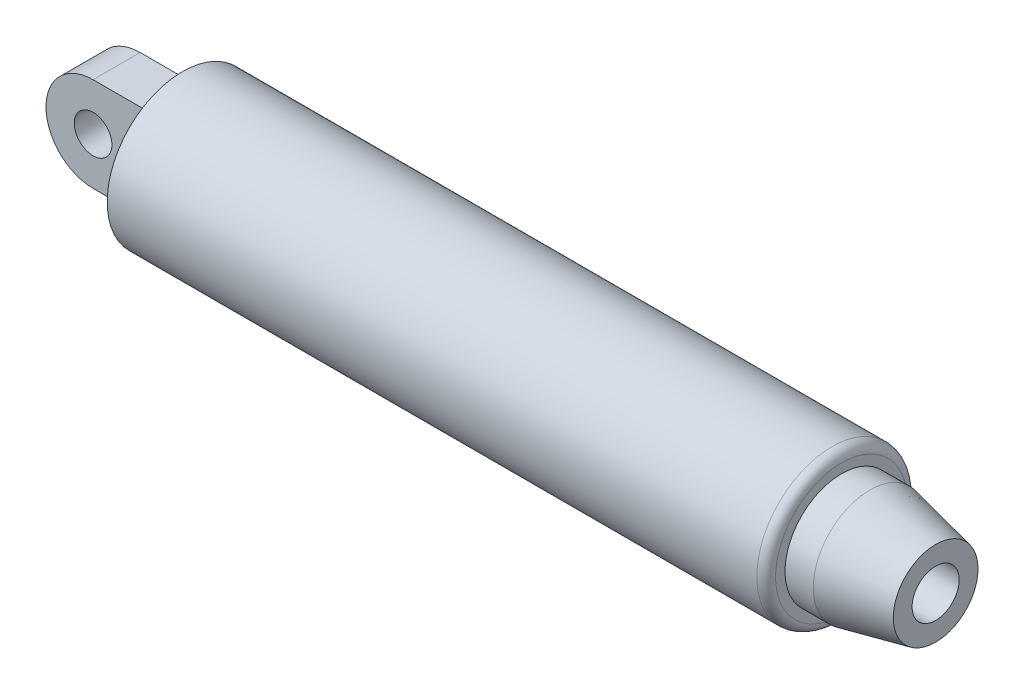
from build123d import *

# Parameters (mm, degrees)
ESQUISSE1_R             = 80
BOSS_EXTRU_1_DEPTH      = 700
ESQUISSE2_R             = 60
BOSS_EXTRU_2_DEPTH      = 100
CHANFREIN1_SIZE         = 70
CHANFREIN1_SIZE2        = 15
ESQUISSE3_R             = 25
ENL_V_MAT_EXTRU_1_DEPTH = 400
CONG_1_R                = 10
ESQUISSE4_R             = 20
BOSS_EXTRU_3_DEPTH      = 25


with BuildPart() as part:
    # Esquisse1 → Boss.-Extru.1 (new body)
    with BuildSketch(Plane(origin=(0, 0, 0), x_dir=(0, 0, -1), z_dir=(1, 0, 0))):
        Circle(ESQUISSE1_R)
    extrude(amount=BOSS_EXTRU_1_DEPTH)

    # Esquisse2 → Boss.-Extru.2 (add)
    with BuildSketch(Plane(origin=(700, 0, 0), x_dir=(0, 0, -1), z_dir=(1, 0, 0))):
        Circle(ESQUISSE2_R)
    extrude(amount=BOSS_EXTRU_2_DEPTH)

    # Chanfrein1
    chanfrein1_edges = [part.edges().sort_by_distance(p)[0] for p in [
        (800, 0, 60),
    ]]
    chanfrein1_side = [part.faces().sort_by_distance(p)[0] for p in [
        (750, 0, 60),
    ]]
    chamfer(chanfrein1_edges, length=CHANFREIN1_SIZE, length2=CHANFREIN1_SIZE2, reference=chanfrein1_side[0])

    # Esquisse3 → Enl_v. mat.-Extru.1 (cut)
    with BuildSketch(Plane(origin=(800, 0, 0), x_dir=(0, 0, -1), z_dir=(1, 0, 0))):
        Circle(ESQUISSE3_R)
    extrude(amount=-ENL_V_MAT_EXTRU_1_DEPTH, mode=Mode.SUBTRACT)

    # Cong_1
    cong_1_edges = [part.edges().sort_by_distance(p)[0] for p in [
        (700, 0, 80),
    ]]
    fillet(cong_1_edges, radius=CONG_1_R)

    # Esquisse4 → Boss.-Extru.3 (add, symmetric)
    with BuildSketch(Plane.XY):
        with BuildLine():
            Line((-70, 50), (0, 50))
            Line((0, 50), (0, -50))
            Line((0, -50), (-70, -50))
            ThreePointArc((-70, -50), (-120, 0), (-70, 50))
        make_face()
        with Locations((-70, 0)):
            Circle(ESQUISSE4_R, mode=Mode.SUBTRACT)
    extrude(amount=BOSS_EXTRU_3_DEPTH, both=True)


solid = part.part
